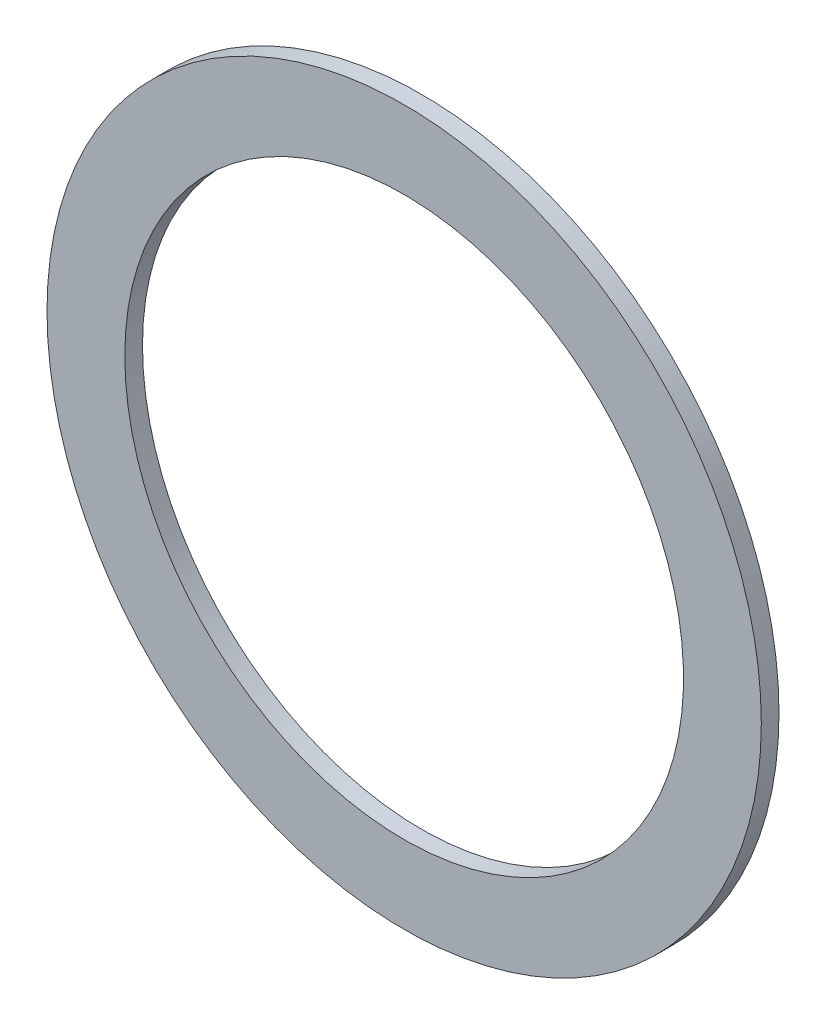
from build123d import *

# Parameters (mm, degrees)
ESQUISSE2_W = 4.4
ESQUISSE2_H = 1


with BuildPart() as part:
    # Esquisse2 → R_volution1 (revolve)
    with BuildSketch(Plane(origin=(0, 0, 0), x_dir=(-1, 0, 0), z_dir=(0, 1, 0)), mode=Mode.PRIVATE) as r_volution1_sk:
        with Locations((-18, 0.5)):
            Rectangle(ESQUISSE2_W, ESQUISSE2_H)
    revolve(r_volution1_sk.sketch.rotate(Axis((0, 0, 0), (0, 0, 1)), 180), axis=Axis((0, 0, 0), (0, 0, 1)))


solid = part.part
